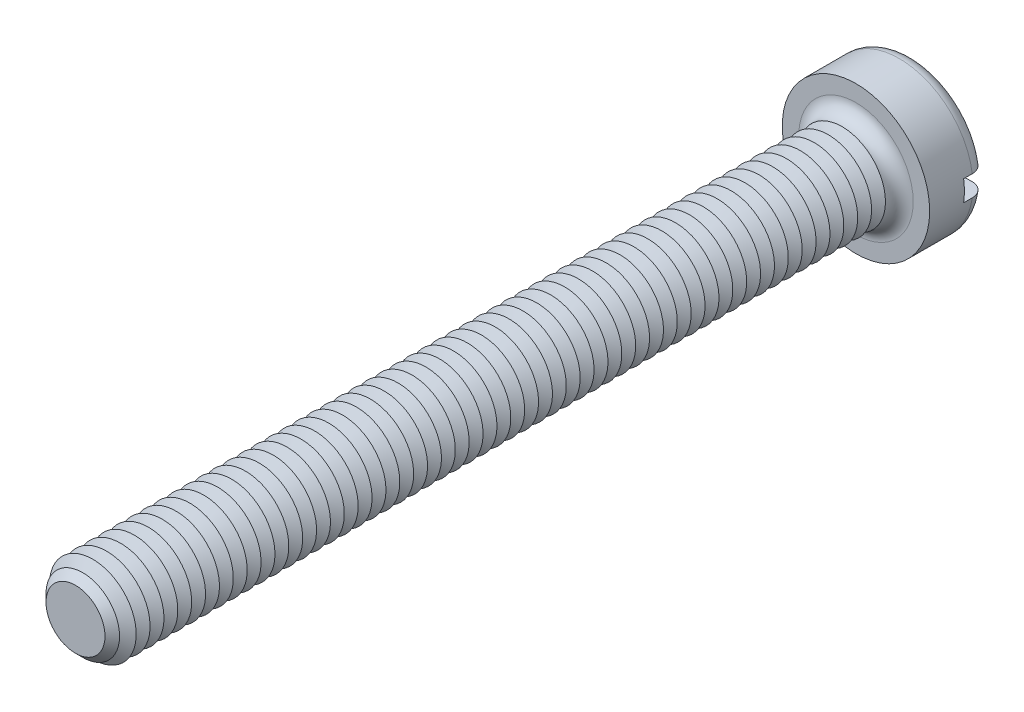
from build123d import *

# Parameters (mm, degrees)
SKETCH3_R           = 4.25
BOSS_EXTRUDE2_DEPTH = 3.3
SKETCH4_R           = 2.5
BOSS_EXTRUDE3_DEPTH = 45
FILLET1_R           = 0.8
CHAMFER1_SIZE       = 0.8
LPATTERN1_COUNT     = 56
LPATTERN1_PITCH     = 0.8
SKETCH8_W           = 8.5
SKETCH8_H           = 1.2
CUT_EXTRUDE1_DEPTH  = 1.3


with BuildPart() as part:
    # Sketch3 → Boss-Extrude2 (new body)
    with BuildSketch(Plane.XY):
        Circle(SKETCH3_R)
    extrude(amount=-BOSS_EXTRUDE2_DEPTH)

    # Sketch4 → Boss-Extrude3 (add)
    with BuildSketch(Plane.XY):
        with Locations(Location((0, 0, 0), (0, 0, 180))):
            Circle(SKETCH4_R)
    extrude(amount=BOSS_EXTRUDE3_DEPTH)

    # Fillet1
    fillet1_edges = [part.edges().sort_by_distance(p)[0] for p in [
        (-4.25, 0, -3.3),
        (2.5, 0, 0),
    ]]
    fillet(fillet1_edges, radius=FILLET1_R)

    # Chamfer1
    chamfer1_edges = [part.edges().sort_by_distance(p)[0] for p in [
        (2.5, 0, 45),
    ]]
    chamfer(chamfer1_edges, length=CHAMFER1_SIZE)

    # Sketch6 → Cut-Revolve1 (revolve, cut)
    with BuildSketch(Plane(origin=(0, 0, 0), x_dir=(0, 0, -1), z_dir=(1, 0, 0)), mode=Mode.PRIVATE) as cut_revolve1_sk:
        Polygon((-0.8, 2.5), (-1.2, 1.807179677), (-1.6, 2.5), align=None)
    cut_revolve1 = revolve(cut_revolve1_sk.sketch.rotate(Axis((0, 0, -1.694361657), (0, 0, 1)), 90), axis=Axis((0, 0, -1.694361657), (0, 0, 1)), mode=Mode.SUBTRACT)

    # LPattern1: Cut-Revolve1 ×56
    with Locations(*[(0, 0, i * LPATTERN1_PITCH) for i in range(1, LPATTERN1_COUNT)]):
        add(cut_revolve1, mode=Mode.SUBTRACT)

    # Sketch8 → Cut-Extrude1 (cut)
    with BuildSketch(Plane(origin=(0, 0, -3.3), x_dir=(-1, 0, 0), z_dir=(0, 0, -1))):
        Rectangle(SKETCH8_W, SKETCH8_H)
    extrude(amount=-CUT_EXTRUDE1_DEPTH, mode=Mode.SUBTRACT)


solid = part.part
